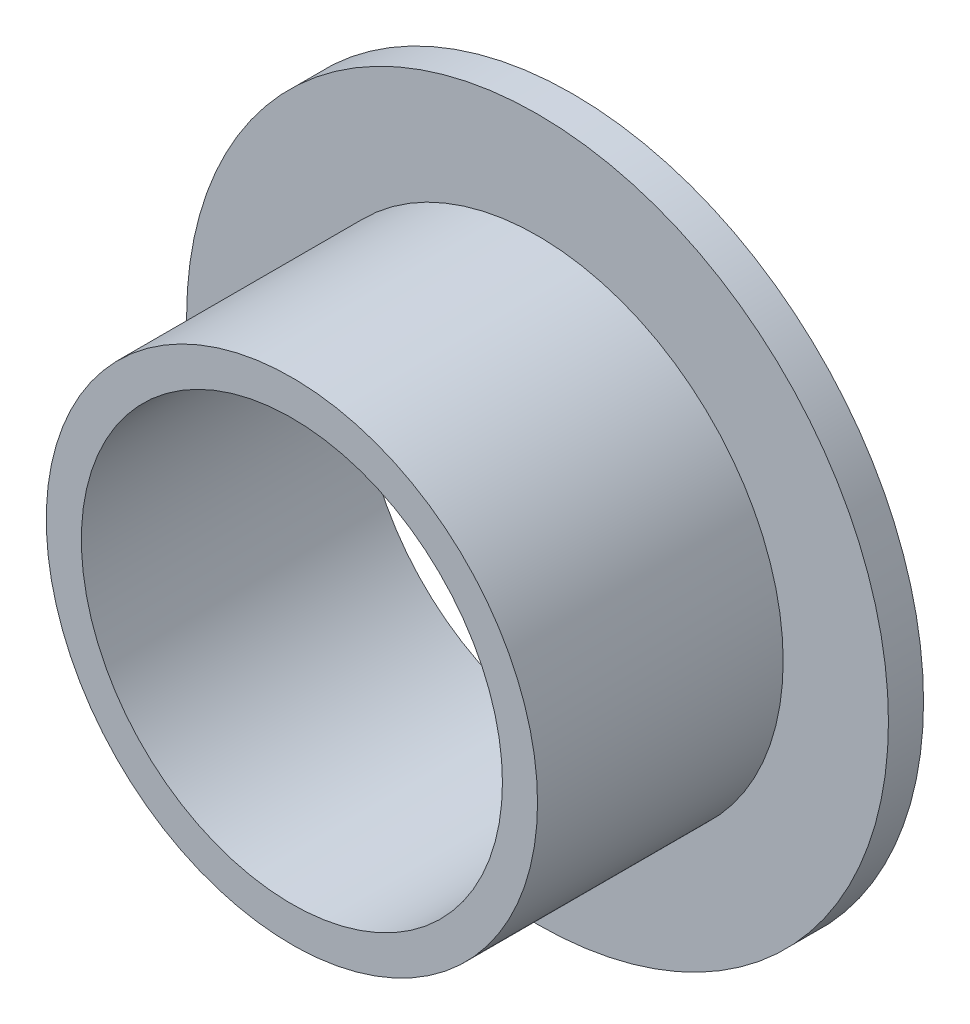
ISO-10303-21;
HEADER;
FILE_DESCRIPTION(('STEP AP214'),'2;1');
FILE_NAME('part.step','',(''),(''),'','','');
FILE_SCHEMA(('AUTOMOTIVE_DESIGN { 1 0 10303 214 1 1 1 1 }'));
ENDSEC;
DATA;
#1=APPLICATION_CONTEXT('core data for automotive mechanical design processes');
#2=APPLICATION_PROTOCOL_DEFINITION('international standard','automotive_design',2000,#1);
#3=PRODUCT_CONTEXT('',#1,'mechanical');
#4=PRODUCT('Part','Part','',(#3));
#5=PRODUCT_RELATED_PRODUCT_CATEGORY('part','',(#4));
#6=PRODUCT_DEFINITION_FORMATION('','',#4);
#7=PRODUCT_DEFINITION_CONTEXT('part definition',#1,'design');
#8=PRODUCT_DEFINITION('design','',#6,#7);
#9=PRODUCT_DEFINITION_SHAPE('','',#8);
#10=(LENGTH_UNIT() NAMED_UNIT(*) SI_UNIT(.MILLI.,.METRE.));
#11=(NAMED_UNIT(*) PLANE_ANGLE_UNIT() SI_UNIT($,.RADIAN.));
#12=(NAMED_UNIT(*) SI_UNIT($,.STERADIAN.) SOLID_ANGLE_UNIT());
#13=UNCERTAINTY_MEASURE_WITH_UNIT(LENGTH_MEASURE(1.E-05),#10,'distance_accuracy_value','');
#14=(GEOMETRIC_REPRESENTATION_CONTEXT(3) GLOBAL_UNCERTAINTY_ASSIGNED_CONTEXT((#13)) GLOBAL_UNIT_ASSIGNED_CONTEXT((#10,
#11,#12)) REPRESENTATION_CONTEXT('',''));
#15=CARTESIAN_POINT('',(0.,0.,0.));
#16=DIRECTION('',(0.,0.,1.));
#17=DIRECTION('',(1.,0.,0.));
#18=AXIS2_PLACEMENT_3D('',#15,#16,#17);
#19=CARTESIAN_POINT('',(0.,0.,-1.));
#20=DIRECTION('',(0.,0.,1.));
#21=DIRECTION('',(1.,0.,0.));
#22=AXIS2_PLACEMENT_3D('',#19,#20,#21);
#23=CYLINDRICAL_SURFACE('',#22,6.);
#24=CARTESIAN_POINT('',(0.,0.,-1.));
#25=DIRECTION('',(0.,0.,1.));
#26=DIRECTION('',(1.,0.,0.));
#27=AXIS2_PLACEMENT_3D('',#24,#25,#26);
#28=CIRCLE('',#27,6.);
#29=CARTESIAN_POINT('',(6.,0.,-1.));
#30=VERTEX_POINT('',#29);
#31=EDGE_CURVE('E46',#30,#30,#28,.T.);
#32=ORIENTED_EDGE('',*,*,#31,.F.);
#33=EDGE_LOOP('',(#32));
#34=FACE_BOUND('',#33,.T.);
#35=CARTESIAN_POINT('',(0.,0.,7.));
#36=DIRECTION('',(0.,0.,1.));
#37=DIRECTION('',(1.,0.,0.));
#38=AXIS2_PLACEMENT_3D('',#35,#36,#37);
#39=CIRCLE('',#38,6.);
#40=CARTESIAN_POINT('',(6.,0.,7.));
#41=VERTEX_POINT('',#40);
#42=EDGE_CURVE('E41',#41,#41,#39,.F.);
#43=ORIENTED_EDGE('',*,*,#42,.F.);
#44=EDGE_LOOP('',(#43));
#45=FACE_BOUND('',#44,.T.);
#46=ADVANCED_FACE('F14',(#34,#45),#23,.F.);
#47=CARTESIAN_POINT('',(10.,-10.,-1.));
#48=DIRECTION('',(0.,0.,-1.));
#49=DIRECTION('',(-1.,0.,0.));
#50=AXIS2_PLACEMENT_3D('',#47,#48,#49);
#51=PLANE('',#50);
#52=ORIENTED_EDGE('',*,*,#31,.T.);
#53=EDGE_LOOP('',(#52));
#54=FACE_BOUND('',#53,.T.);
#55=CARTESIAN_POINT('',(0.,0.,-1.));
#56=DIRECTION('',(0.,0.,1.));
#57=DIRECTION('',(1.,0.,0.));
#58=AXIS2_PLACEMENT_3D('',#55,#56,#57);
#59=CIRCLE('',#58,10.);
#60=CARTESIAN_POINT('',(10.,0.,-1.));
#61=VERTEX_POINT('',#60);
#62=EDGE_CURVE('E36',#61,#61,#59,.F.);
#63=ORIENTED_EDGE('',*,*,#62,.T.);
#64=EDGE_LOOP('',(#63));
#65=FACE_BOUND('',#64,.T.);
#66=ADVANCED_FACE('F51',(#54,#65),#51,.T.);
#67=CARTESIAN_POINT('',(-7.,-7.,7.));
#68=DIRECTION('',(0.,0.,1.));
#69=DIRECTION('',(1.,0.,0.));
#70=AXIS2_PLACEMENT_3D('',#67,#68,#69);
#71=PLANE('',#70);
#72=ORIENTED_EDGE('',*,*,#42,.T.);
#73=EDGE_LOOP('',(#72));
#74=FACE_BOUND('',#73,.T.);
#75=CARTESIAN_POINT('',(0.,0.,7.));
#76=DIRECTION('',(0.,0.,1.));
#77=DIRECTION('',(1.,0.,0.));
#78=AXIS2_PLACEMENT_3D('',#75,#76,#77);
#79=CIRCLE('',#78,7.);
#80=CARTESIAN_POINT('',(7.,0.,7.));
#81=VERTEX_POINT('',#80);
#82=EDGE_CURVE('E27',#81,#81,#79,.T.);
#83=ORIENTED_EDGE('',*,*,#82,.T.);
#84=EDGE_LOOP('',(#83));
#85=FACE_BOUND('',#84,.T.);
#86=ADVANCED_FACE('F59',(#74,#85),#71,.T.);
#87=CARTESIAN_POINT('',(0.,0.,-1.));
#88=DIRECTION('',(0.,0.,1.));
#89=DIRECTION('',(1.,0.,0.));
#90=AXIS2_PLACEMENT_3D('',#87,#88,#89);
#91=CYLINDRICAL_SURFACE('',#90,10.);
#92=ORIENTED_EDGE('',*,*,#62,.F.);
#93=EDGE_LOOP('',(#92));
#94=FACE_BOUND('',#93,.T.);
#95=CARTESIAN_POINT('',(0.,0.,0.));
#96=DIRECTION('',(0.,0.,1.));
#97=DIRECTION('',(1.,0.,0.));
#98=AXIS2_PLACEMENT_3D('',#95,#96,#97);
#99=CIRCLE('',#98,10.);
#100=CARTESIAN_POINT('',(10.,0.,0.));
#101=VERTEX_POINT('',#100);
#102=EDGE_CURVE('E22',#101,#101,#99,.T.);
#103=ORIENTED_EDGE('',*,*,#102,.F.);
#104=EDGE_LOOP('',(#103));
#105=FACE_BOUND('',#104,.T.);
#106=ADVANCED_FACE('F62',(#94,#105),#91,.T.);
#107=CARTESIAN_POINT('',(0.,0.,0.));
#108=DIRECTION('',(0.,0.,1.));
#109=DIRECTION('',(1.,0.,0.));
#110=AXIS2_PLACEMENT_3D('',#107,#108,#109);
#111=CYLINDRICAL_SURFACE('',#110,7.);
#112=CARTESIAN_POINT('',(0.,0.,0.));
#113=DIRECTION('',(0.,0.,1.));
#114=DIRECTION('',(1.,0.,0.));
#115=AXIS2_PLACEMENT_3D('',#112,#113,#114);
#116=CIRCLE('',#115,7.);
#117=CARTESIAN_POINT('',(7.,0.,0.));
#118=VERTEX_POINT('',#117);
#119=EDGE_CURVE('E10',#118,#118,#116,.F.);
#120=ORIENTED_EDGE('',*,*,#119,.F.);
#121=EDGE_LOOP('',(#120));
#122=FACE_BOUND('',#121,.T.);
#123=ORIENTED_EDGE('',*,*,#82,.F.);
#124=EDGE_LOOP('',(#123));
#125=FACE_BOUND('',#124,.T.);
#126=ADVANCED_FACE('F65',(#122,#125),#111,.T.);
#127=CARTESIAN_POINT('',(-10.,-10.,0.));
#128=DIRECTION('',(0.,0.,1.));
#129=DIRECTION('',(1.,0.,0.));
#130=AXIS2_PLACEMENT_3D('',#127,#128,#129);
#131=PLANE('',#130);
#132=ORIENTED_EDGE('',*,*,#119,.T.);
#133=EDGE_LOOP('',(#132));
#134=FACE_BOUND('',#133,.T.);
#135=ORIENTED_EDGE('',*,*,#102,.T.);
#136=EDGE_LOOP('',(#135));
#137=FACE_BOUND('',#136,.T.);
#138=ADVANCED_FACE('F16',(#134,#137),#131,.T.);
#139=CLOSED_SHELL('',(#46,#66,#86,#106,#126,#138));
#140=MANIFOLD_SOLID_BREP('B1',#139);
#141=ADVANCED_BREP_SHAPE_REPRESENTATION('',(#18,#140),#14);
#142=SHAPE_DEFINITION_REPRESENTATION(#9,#141);
ENDSEC;
END-ISO-10303-21;
